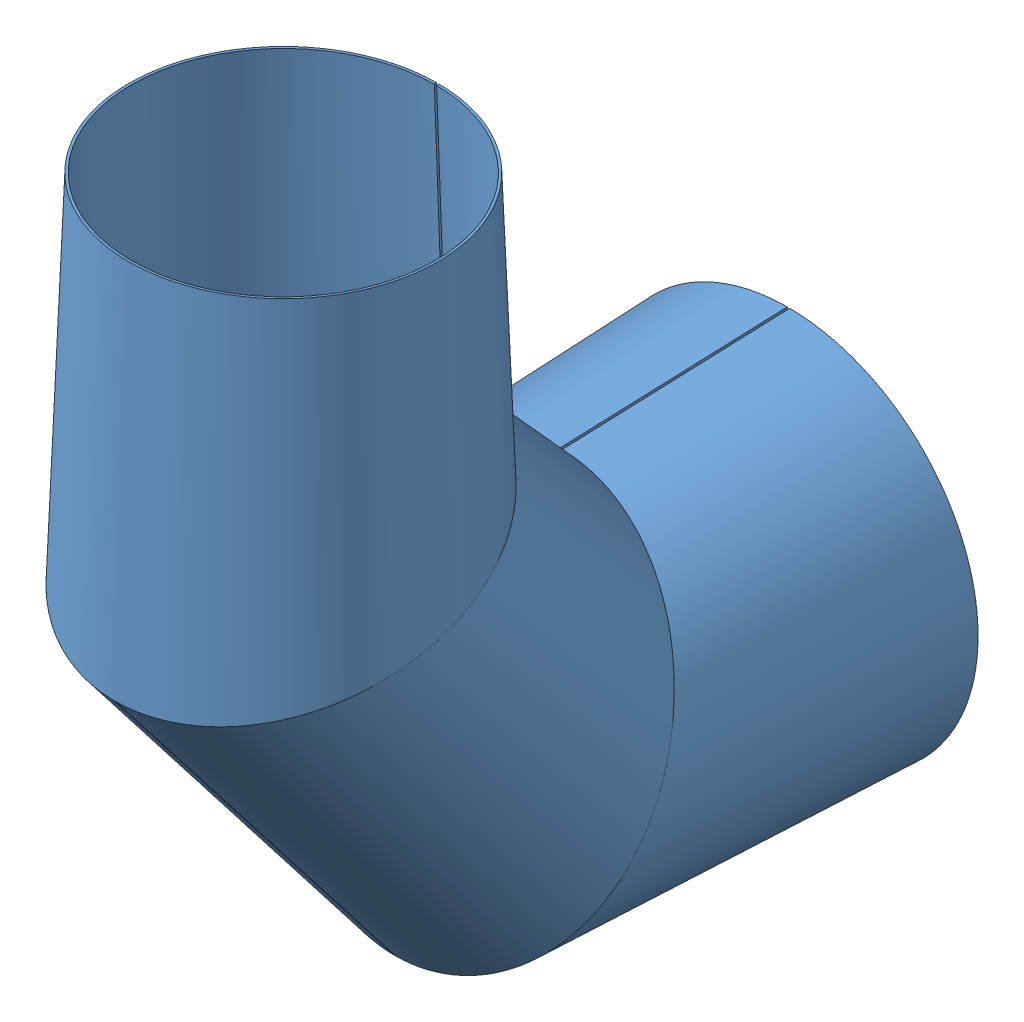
SolidWorks assembly SEGMENT.SLDASM, configuration Standard (file format 3400). Lengths in mm.
Overall size (81.59 160.76 150.41).
3 component instances, 1 part files, 6 mates.
Components (placement in the parent):
- STOZEK-1: STOZEK.SLDPRT [1] at origin size (81.55 82 86.85)
- STOZEK-2: STOZEK.SLDPRT [2] at (0 -49.7403 23.1943) x (-1 0 0) z (0 0.766044 0.642788) size (81.55 81.55 102.65)
- STOZEK-3: STOZEK.SLDPRT [3] at (0 -80.5816 107.93) x (1 0 0) z (0 1 0) size (75.65 75.64 82.12)
Mates (geometry in assembly coordinates):
- Deckungsgleich5: coincident anti-aligned: plane of ?; plane of assembly
- Deckungsgleich6: coincident aligned: unknown of STOZEK-3
- Deckungsgleich7: coincident anti-aligned: plane of ?; plane of ?
- Deckungsgleich8: coincident anti-aligned: unknown of STOZEK-3
- Deckungsgleich9: coincident: point of ?; curve of ?
- Deckungsgleich10: coincident: unknown of STOZEK-3
